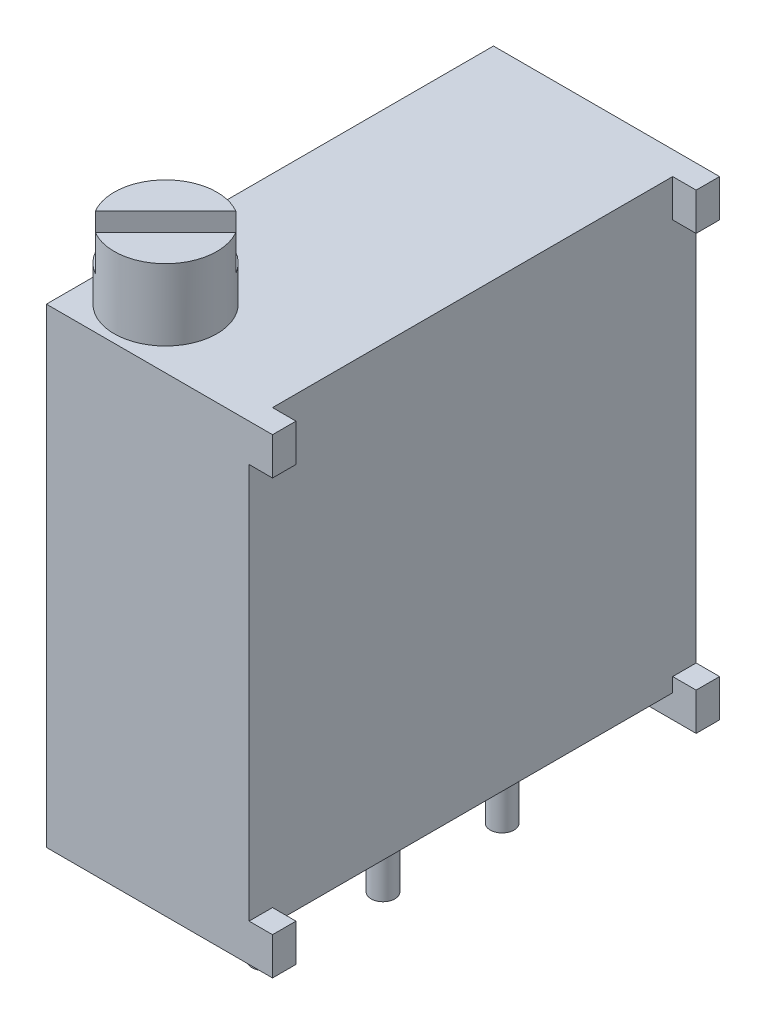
from build123d import *

# Parameters (mm, degrees)
EXTRUDE_1_DEPTH      = 2.41
SKETCH_2_OUTSIDE_W   = 14.46
SKETCH_2_OUTSIDE_H   = 14.96
SKETCH_2_OUTSIDE_W_2 = 0.5
SKETCH_2_OUTSIDE_H_2 = 0.8
CUT_EXTRUDE_1_DEPTH  = 0.5
SKETCH_3_R           = 0.255
EXTRUDE_2_DEPTH      = 2.5
SKETCH_4_R           = 1.095
EXTRUDE_3_DEPTH      = 1.52
CUT_EXTRUDE_2_DEPTH  = 0.76


with BuildPart() as part:
    # Sketch 1 → Extrude 1 (new, symmetric)
    with BuildSketch(Plane(origin=(0, 0, 0), x_dir=(0, 0, -1), z_dir=(1, 0, 0))):
        Polygon((6.805, 0), (7.305, 0), (7.305, 10.03), (-2.225, 10.03), (-2.225, 0), (-1.725, 0), (-1.725, 0.5), (6.805, 0.5), align=None)
    extrude(amount=EXTRUDE_1_DEPTH, both=True)

    # Sketch 2 outside → Cut-Extrude 1 (cut)
    with BuildSketch(Plane(origin=(2.41, 0, 0), x_dir=(0, 0, -1), z_dir=(1, 0, 0))):
        with Locations((2.54, 5.015)):
            Rectangle(SKETCH_2_OUTSIDE_W, SKETCH_2_OUTSIDE_H)
        with Locations((-1.975, 0.4)):
            Rectangle(SKETCH_2_OUTSIDE_W_2, SKETCH_2_OUTSIDE_H_2, mode=Mode.SUBTRACT)
        with Locations((-1.975, 9.63)):
            Rectangle(SKETCH_2_OUTSIDE_W_2, SKETCH_2_OUTSIDE_H_2, mode=Mode.SUBTRACT)
        with Locations((7.055, 9.63)):
            Rectangle(SKETCH_2_OUTSIDE_W_2, SKETCH_2_OUTSIDE_H_2, mode=Mode.SUBTRACT)
        with Locations((7.055, 0.4)):
            Rectangle(SKETCH_2_OUTSIDE_W_2, SKETCH_2_OUTSIDE_H_2, mode=Mode.SUBTRACT)
    extrude(amount=-CUT_EXTRUDE_1_DEPTH, mode=Mode.SUBTRACT)

    # Sketch 3 → Extrude 2 (add)
    with BuildSketch(Plane.XZ.offset(-0.5)):
        with Locations(Location((0, 0, 0), (0, 0, 90))):
            Circle(SKETCH_3_R)
        with Locations(Location((0, -2.54, 0), (0, 0, 90))):
            Circle(SKETCH_3_R)
        with Locations(Location((0, -5.08, 0), (0, 0, 90))):
            Circle(SKETCH_3_R)
    extrude(amount=EXTRUDE_2_DEPTH)

    # Sketch 4 → Extrude 3 (add)
    with BuildSketch(Plane(origin=(0, 10.03, 0), x_dir=(-1, 0, 0), z_dir=(0, 1, 0))):
        with Locations(Location((1.14, 0.955, 0), (0, 0, 270))):
            Circle(SKETCH_4_R)
    extrude(amount=EXTRUDE_3_DEPTH)

    # Sketch 5 → Cut-Extrude 2 (cut)
    with BuildSketch(Plane(origin=(0, 11.55, 0), x_dir=(-1, 0, 0), z_dir=(0, 1, 0))):
        Polygon((1.716292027, 1.927271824), (0.167728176, 0.378707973), (0.563707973, -0.017271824), (2.112271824, 1.531292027), align=None)
    extrude(amount=-CUT_EXTRUDE_2_DEPTH, mode=Mode.SUBTRACT)


solid = part.part
